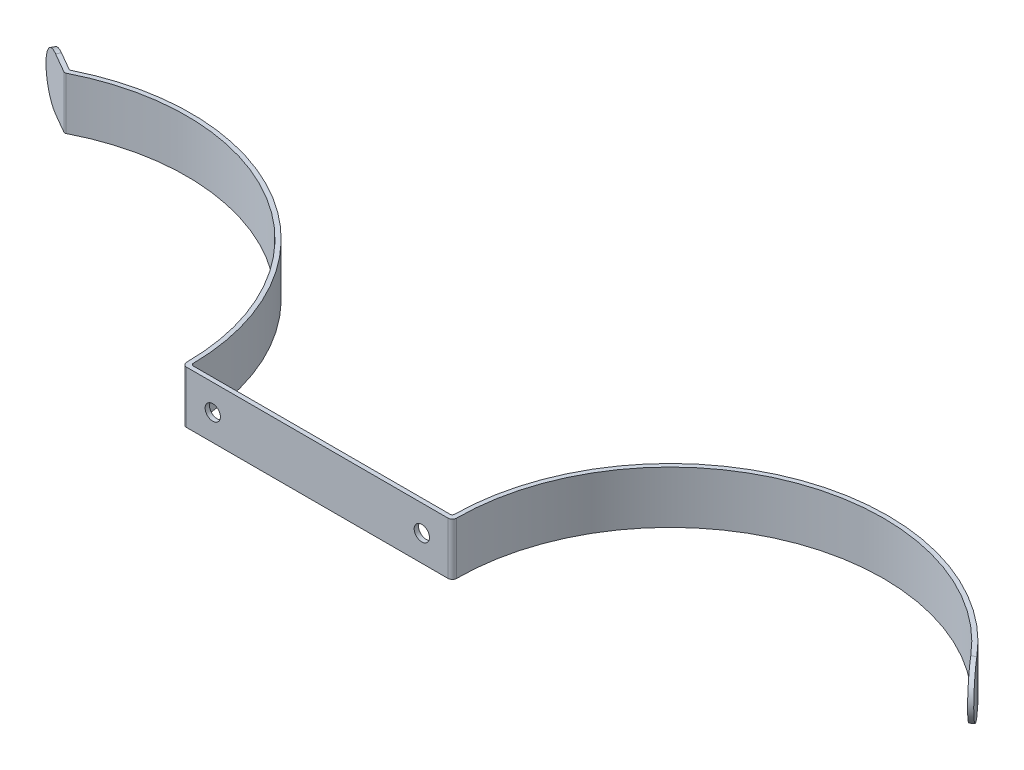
from build123d import *

# Parameters (mm, degrees)
EXTRUDE1_DEPTH     = 12
SKETCH2_R          = 1.75
CUT_EXTRUDE1_DEPTH = 209.573082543
CUT_EXTRUDE2_DEPTH = 200.289902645
CUT_EXTRUDE3_DEPTH = 191.629094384


with BuildPart() as part:
    # Sketch1 → Extrude1 (new body)
    with BuildSketch(Plane(origin=(0, 0, 0), x_dir=(1, 0, 0), z_dir=(0, 1, 0))):
        with BuildLine():
            Line((50.497524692, 0), (109.502475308, 0))
            ThreePointArc((109.502475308, 0), (109.854274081, 0.144700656), (110.0024508, 0.495049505))
            ThreePointArc((110.0024508, 0.495049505), (143.083322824, 47.051312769), (198.235923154, 32.218227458))
            Line((198.235923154, 32.218227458), (202.102110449, 27.62991668))
            Line((202.102110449, 27.62991668), (201.337391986, 26.98555213))
            Line((201.337391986, 26.98555213), (197.471204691, 31.573862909))
            ThreePointArc((197.471204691, 31.573862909), (143.193587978, 46.027649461), (111, 0))
            ThreePointArc((111, 0), (110.707106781, -0.707106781), (110, -1))
            Line((110, -1), (50, -1))
            ThreePointArc((50, -1), (49.292893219, -0.707106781), (49, 0))
            ThreePointArc((49, 0), (25.566306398, 41.801482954), (-22.32097866, 43.620796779))
            ThreePointArc((-22.32097866, 43.620796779), (-22.561400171, 43.566067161), (-22.798743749, 43.632894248))
            Line((-22.798743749, 43.632894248), (-32.559848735, 49.26847084))
            Line((-32.559848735, 49.26847084), (-32.059848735, 50.134496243))
            Line((-32.059848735, 50.134496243), (-22.766882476, 44.769199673))
            ThreePointArc((-22.766882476, 44.769199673), (-22.532240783, 44.702448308), (-22.293943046, 44.754665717))
            ThreePointArc((-22.293943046, 44.754665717), (26.107486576, 42.642691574), (49.9975492, 0.495049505))
            ThreePointArc((49.9975492, 0.495049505), (50.145725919, 0.144700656), (50.497524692, 0))
        make_face()
    extrude(amount=EXTRUDE1_DEPTH)

    # Sketch2 → Cut-Extrude1 (cut, through all)
    with BuildSketch(Plane(origin=(0, 0, 0), x_dir=(-1, 0, 0), z_dir=(0, 0, -1))):
        with Locations((-56, 6)):
            Circle(SKETCH2_R)
        with Locations((-104, 6)):
            Circle(SKETCH2_R)
    extrude(amount=-CUT_EXTRUDE1_DEPTH, mode=Mode.SUBTRACT)

    # Sketch3 → Cut-Extrude2 (cut, through all)
    with BuildSketch(Plane(origin=(131.8030156, 0, -111.05942229), x_dir=(-0.6443645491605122, 0, -0.7647184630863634), z_dir=(0.7647184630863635, 0, -0.6443645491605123))):
        with BuildLine():
            ThreePointArc((-109.098327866, 6.000000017), (-107.340968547, 10.242640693), (-103.098327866, 12))
            Line((-103.098327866, 12), (-109.098327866, 12))
            Line((-109.098327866, 12), (-109.098327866, 6.000000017))
        make_face()
        with BuildLine():
            ThreePointArc((-103.098327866, 0), (-107.340968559, 1.757359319), (-109.098327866, 6.000000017))
            Line((-109.098327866, 6.000000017), (-109.098327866, 0))
            Line((-109.098327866, 0), (-103.098327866, 0))
        make_face()
    extrude(amount=-CUT_EXTRUDE2_DEPTH, mode=Mode.SUBTRACT)

    # Sketch4 → Cut-Extrude3 (cut, through all)
    with BuildSketch(Plane(origin=(13.693911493, 0, -23.71855046), x_dir=(-0.8660254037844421, 0, -0.49999999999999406), z_dir=(0.499999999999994, 0, -0.866025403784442))):
        with BuildLine():
            Line((52.831891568, 6), (52.831891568, 12))
            Line((52.831891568, 12), (46.831891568, 12))
            ThreePointArc((46.831891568, 12), (51.074532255, 10.242640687), (52.831891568, 6))
        make_face()
        with BuildLine():
            Line((52.831891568, 0), (52.831891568, 6))
            ThreePointArc((52.831891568, 6), (51.074532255, 1.757359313), (46.831891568, 0))
            Line((46.831891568, 0), (52.831891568, 0))
        make_face()
    extrude(amount=-CUT_EXTRUDE3_DEPTH, mode=Mode.SUBTRACT)


solid = part.part
